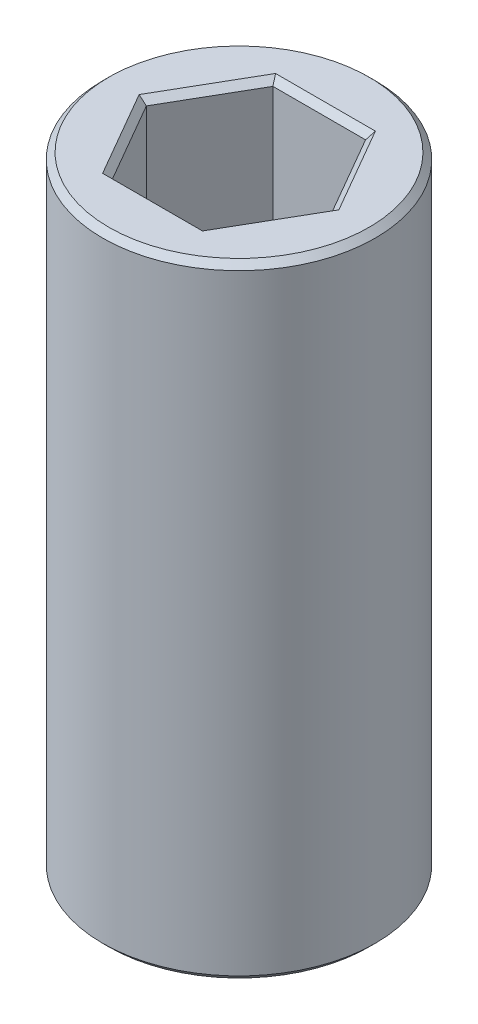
ISO-10303-21;
HEADER;
FILE_DESCRIPTION(('STEP AP214'),'2;1');
FILE_NAME('part.step','',(''),(''),'','','');
FILE_SCHEMA(('AUTOMOTIVE_DESIGN { 1 0 10303 214 1 1 1 1 }'));
ENDSEC;
DATA;
#1=APPLICATION_CONTEXT('core data for automotive mechanical design processes');
#2=APPLICATION_PROTOCOL_DEFINITION('international standard','automotive_design',2000,#1);
#3=PRODUCT_CONTEXT('',#1,'mechanical');
#4=PRODUCT('Part','Part','',(#3));
#5=PRODUCT_RELATED_PRODUCT_CATEGORY('part','',(#4));
#6=PRODUCT_DEFINITION_FORMATION('','',#4);
#7=PRODUCT_DEFINITION_CONTEXT('part definition',#1,'design');
#8=PRODUCT_DEFINITION('design','',#6,#7);
#9=PRODUCT_DEFINITION_SHAPE('','',#8);
#10=(LENGTH_UNIT() NAMED_UNIT(*) SI_UNIT(.MILLI.,.METRE.));
#11=(NAMED_UNIT(*) PLANE_ANGLE_UNIT() SI_UNIT($,.RADIAN.));
#12=(NAMED_UNIT(*) SI_UNIT($,.STERADIAN.) SOLID_ANGLE_UNIT());
#13=UNCERTAINTY_MEASURE_WITH_UNIT(LENGTH_MEASURE(1.E-05),#10,'distance_accuracy_value','');
#14=(GEOMETRIC_REPRESENTATION_CONTEXT(3) GLOBAL_UNCERTAINTY_ASSIGNED_CONTEXT((#13)) GLOBAL_UNIT_ASSIGNED_CONTEXT((#10,
#11,#12)) REPRESENTATION_CONTEXT('',''));
#15=CARTESIAN_POINT('',(0.,0.,0.));
#16=DIRECTION('',(0.,0.,1.));
#17=DIRECTION('',(1.,0.,0.));
#18=AXIS2_PLACEMENT_3D('',#15,#16,#17);
#19=CARTESIAN_POINT('',(0.,50.8,0.));
#20=DIRECTION('',(0.,1.,0.));
#21=DIRECTION('',(0.,0.,1.));
#22=AXIS2_PLACEMENT_3D('',#19,#20,#21);
#23=PLANE('',#22);
#24=CARTESIAN_POINT('',(0.,50.8,0.));
#25=DIRECTION('',(0.,1.,0.));
#26=DIRECTION('',(0.,0.,1.));
#27=AXIS2_PLACEMENT_3D('',#24,#25,#26);
#28=CIRCLE('',#27,10.6045);
#29=CARTESIAN_POINT('',(0.,50.8,10.6045));
#30=VERTEX_POINT('',#29);
#31=EDGE_CURVE('E13',#30,#30,#28,.T.);
#32=ORIENTED_EDGE('',*,*,#31,.T.);
#33=EDGE_LOOP('',(#32));
#34=FACE_BOUND('',#33,.T.);
#35=DIRECTION('',(-0.500000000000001,0.,-0.866025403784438));
#36=VECTOR('',#35,1.);
#37=CARTESIAN_POINT('',(-6.10418005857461,50.8,3.52425));
#38=LINE('',#37,#36);
#39=CARTESIAN_POINT('',(-4.06945337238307,50.8,7.0485));
#40=VERTEX_POINT('',#39);
#41=CARTESIAN_POINT('',(-8.13890674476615,50.8,0.));
#42=VERTEX_POINT('',#41);
#43=EDGE_CURVE('E70',#40,#42,#38,.T.);
#44=ORIENTED_EDGE('',*,*,#43,.T.);
#45=DIRECTION('',(0.5,0.,-0.866025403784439));
#46=VECTOR('',#45,1.);
#47=CARTESIAN_POINT('',(-6.10418005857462,50.8,-3.52425));
#48=LINE('',#47,#46);
#49=CARTESIAN_POINT('',(-4.06945337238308,50.8,-7.0485));
#50=VERTEX_POINT('',#49);
#51=EDGE_CURVE('E62',#42,#50,#48,.T.);
#52=ORIENTED_EDGE('',*,*,#51,.T.);
#53=DIRECTION('',(1.,0.,0.));
#54=VECTOR('',#53,1.);
#55=CARTESIAN_POINT('',(0.,50.8,-7.0485));
#56=LINE('',#55,#54);
#57=CARTESIAN_POINT('',(4.06945337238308,50.8,-7.0485));
#58=VERTEX_POINT('',#57);
#59=EDGE_CURVE('E238',#50,#58,#56,.T.);
#60=ORIENTED_EDGE('',*,*,#59,.T.);
#61=DIRECTION('',(0.5,0.,0.866025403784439));
#62=VECTOR('',#61,1.);
#63=CARTESIAN_POINT('',(6.10418005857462,50.8,-3.52425));
#64=LINE('',#63,#62);
#65=CARTESIAN_POINT('',(8.13890674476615,50.8,0.));
#66=VERTEX_POINT('',#65);
#67=EDGE_CURVE('E241',#58,#66,#64,.T.);
#68=ORIENTED_EDGE('',*,*,#67,.T.);
#69=DIRECTION('',(-0.499999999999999,0.,0.866025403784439));
#70=VECTOR('',#69,1.);
#71=CARTESIAN_POINT('',(6.10418005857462,50.8,3.52425));
#72=LINE('',#71,#70);
#73=CARTESIAN_POINT('',(4.06945337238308,50.8,7.0485));
#74=VERTEX_POINT('',#73);
#75=EDGE_CURVE('E244',#66,#74,#72,.T.);
#76=ORIENTED_EDGE('',*,*,#75,.T.);
#77=DIRECTION('',(-1.,0.,0.));
#78=VECTOR('',#77,1.);
#79=CARTESIAN_POINT('',(0.,50.8,7.0485));
#80=LINE('',#79,#78);
#81=EDGE_CURVE('E75',#74,#40,#80,.T.);
#82=ORIENTED_EDGE('',*,*,#81,.T.);
#83=EDGE_LOOP('',(#44,#52,#60,#68,#76,#82));
#84=FACE_BOUND('',#83,.T.);
#85=ADVANCED_FACE('F51',(#34,#84),#23,.T.);
#86=CARTESIAN_POINT('',(0.,0.,0.));
#87=DIRECTION('',(0.,1.,0.));
#88=DIRECTION('',(0.,0.,1.));
#89=AXIS2_PLACEMENT_3D('',#86,#87,#88);
#90=PLANE('',#89);
#91=DIRECTION('',(0.499999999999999,0.,-0.866025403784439));
#92=VECTOR('',#91,1.);
#93=CARTESIAN_POINT('',(7.99225977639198,0.,0.253999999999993));
#94=LINE('',#93,#92);
#95=CARTESIAN_POINT('',(4.06945337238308,0.,7.0485));
#96=VERTEX_POINT('',#95);
#97=CARTESIAN_POINT('',(8.13890674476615,0.,0.));
#98=VERTEX_POINT('',#97);
#99=EDGE_CURVE('E149',#96,#98,#94,.T.);
#100=ORIENTED_EDGE('',*,*,#99,.T.);
#101=DIRECTION('',(-0.5,0.,-0.866025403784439));
#102=VECTOR('',#101,1.);
#103=CARTESIAN_POINT('',(4.21610034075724,0.,-6.7945));
#104=LINE('',#103,#102);
#105=CARTESIAN_POINT('',(4.06945337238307,0.,-7.0485));
#106=VERTEX_POINT('',#105);
#107=EDGE_CURVE('E190',#98,#106,#104,.T.);
#108=ORIENTED_EDGE('',*,*,#107,.T.);
#109=DIRECTION('',(-1.,0.,0.));
#110=VECTOR('',#109,1.);
#111=CARTESIAN_POINT('',(-3.77615943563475,0.,-7.0485));
#112=LINE('',#111,#110);
#113=CARTESIAN_POINT('',(-4.06945337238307,0.,-7.0485));
#114=VERTEX_POINT('',#113);
#115=EDGE_CURVE('E187',#106,#114,#112,.T.);
#116=ORIENTED_EDGE('',*,*,#115,.T.);
#117=DIRECTION('',(-0.5,0.,0.866025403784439));
#118=VECTOR('',#117,1.);
#119=CARTESIAN_POINT('',(-7.99225977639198,0.,-0.253999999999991));
#120=LINE('',#119,#118);
#121=CARTESIAN_POINT('',(-8.13890674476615,0.,0.));
#122=VERTEX_POINT('',#121);
#123=EDGE_CURVE('E184',#114,#122,#120,.T.);
#124=ORIENTED_EDGE('',*,*,#123,.T.);
#125=DIRECTION('',(0.500000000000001,0.,0.866025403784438));
#126=VECTOR('',#125,1.);
#127=CARTESIAN_POINT('',(-4.21610034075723,0.,6.7945));
#128=LINE('',#127,#126);
#129=CARTESIAN_POINT('',(-4.06945337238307,0.,7.0485));
#130=VERTEX_POINT('',#129);
#131=EDGE_CURVE('E152',#122,#130,#128,.T.);
#132=ORIENTED_EDGE('',*,*,#131,.T.);
#133=DIRECTION('',(1.,0.,0.));
#134=VECTOR('',#133,1.);
#135=CARTESIAN_POINT('',(3.77615943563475,0.,7.0485));
#136=LINE('',#135,#134);
#137=EDGE_CURVE('E143',#130,#96,#136,.T.);
#138=ORIENTED_EDGE('',*,*,#137,.T.);
#139=EDGE_LOOP('',(#100,#108,#116,#124,#132,#138));
#140=FACE_BOUND('',#139,.T.);
#141=CARTESIAN_POINT('',(0.,0.,0.));
#142=DIRECTION('',(0.,1.,0.));
#143=DIRECTION('',(0.,0.,1.));
#144=AXIS2_PLACEMENT_3D('',#141,#142,#143);
#145=CIRCLE('',#144,10.6045);
#146=CARTESIAN_POINT('',(0.,0.,10.6045));
#147=VERTEX_POINT('',#146);
#148=EDGE_CURVE('E173',#147,#147,#145,.F.);
#149=ORIENTED_EDGE('',*,*,#148,.T.);
#150=EDGE_LOOP('',(#149));
#151=FACE_BOUND('',#150,.T.);
#152=ADVANCED_FACE('F145',(#140,#151),#90,.F.);
#153=CARTESIAN_POINT('',(0.,50.8,0.));
#154=DIRECTION('',(0.,-1.,0.));
#155=DIRECTION('',(0.,0.,-1.));
#156=AXIS2_PLACEMENT_3D('',#153,#154,#155);
#157=CYLINDRICAL_SURFACE('',#156,11.1125);
#158=CARTESIAN_POINT('',(0.,0.507999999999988,0.));
#159=DIRECTION('',(0.,1.,0.));
#160=DIRECTION('',(0.,0.,1.));
#161=AXIS2_PLACEMENT_3D('',#158,#159,#160);
#162=CIRCLE('',#161,11.1125);
#163=CARTESIAN_POINT('',(0.,0.507999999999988,11.1125));
#164=VERTEX_POINT('',#163);
#165=EDGE_CURVE('E234',#164,#164,#162,.T.);
#166=ORIENTED_EDGE('',*,*,#165,.T.);
#167=EDGE_LOOP('',(#166));
#168=FACE_BOUND('',#167,.T.);
#169=CARTESIAN_POINT('',(0.,50.292,0.));
#170=DIRECTION('',(0.,1.,0.));
#171=DIRECTION('',(0.,0.,1.));
#172=AXIS2_PLACEMENT_3D('',#169,#170,#171);
#173=CIRCLE('',#172,11.1125);
#174=CARTESIAN_POINT('',(0.,50.292,11.1125));
#175=VERTEX_POINT('',#174);
#176=EDGE_CURVE('E230',#175,#175,#173,.F.);
#177=ORIENTED_EDGE('',*,*,#176,.T.);
#178=EDGE_LOOP('',(#177));
#179=FACE_BOUND('',#178,.T.);
#180=ADVANCED_FACE('F387',(#168,#179),#157,.T.);
#181=CARTESIAN_POINT('',(3.77615943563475,50.8,6.5405));
#182=DIRECTION('',(-0.866025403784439,0.,-0.5));
#183=DIRECTION('',(-0.499999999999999,0.,0.866025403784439));
#184=AXIS2_PLACEMENT_3D('',#181,#182,#183);
#185=PLANE('',#184);
#186=DIRECTION('',(0.,-1.,0.));
#187=VECTOR('',#186,1.);
#188=CARTESIAN_POINT('',(7.55231887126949,50.8,0.));
#189=LINE('',#188,#187);
#190=CARTESIAN_POINT('',(7.55231887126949,50.292,0.));
#191=VERTEX_POINT('',#190);
#192=CARTESIAN_POINT('',(7.55231887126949,0.507999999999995,0.));
#193=VERTEX_POINT('',#192);
#194=EDGE_CURVE('E178',#191,#193,#189,.T.);
#195=ORIENTED_EDGE('',*,*,#194,.T.);
#196=DIRECTION('',(-0.499999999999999,0.,0.866025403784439));
#197=VECTOR('',#196,1.);
#198=CARTESIAN_POINT('',(3.77615943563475,0.507999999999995,6.5405));
#199=LINE('',#198,#197);
#200=CARTESIAN_POINT('',(3.77615943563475,0.507999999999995,6.5405));
#201=VERTEX_POINT('',#200);
#202=EDGE_CURVE('E227',#193,#201,#199,.T.);
#203=ORIENTED_EDGE('',*,*,#202,.T.);
#204=DIRECTION('',(0.,-1.,0.));
#205=VECTOR('',#204,1.);
#206=CARTESIAN_POINT('',(3.77615943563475,50.8,6.5405));
#207=LINE('',#206,#205);
#208=CARTESIAN_POINT('',(3.77615943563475,50.292,6.5405));
#209=VERTEX_POINT('',#208);
#210=EDGE_CURVE('E267',#209,#201,#207,.T.);
#211=ORIENTED_EDGE('',*,*,#210,.F.);
#212=DIRECTION('',(0.499999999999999,0.,-0.866025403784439));
#213=VECTOR('',#212,1.);
#214=CARTESIAN_POINT('',(3.77615943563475,50.292,6.5405));
#215=LINE('',#214,#213);
#216=EDGE_CURVE('E224',#209,#191,#215,.T.);
#217=ORIENTED_EDGE('',*,*,#216,.T.);
#218=EDGE_LOOP('',(#195,#203,#211,#217));
#219=FACE_BOUND('',#218,.T.);
#220=ADVANCED_FACE('F335',(#219),#185,.T.);
#221=CARTESIAN_POINT('',(7.55231887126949,50.8,0.));
#222=DIRECTION('',(-0.866025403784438,0.,0.5));
#223=DIRECTION('',(0.5,0.,0.866025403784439));
#224=AXIS2_PLACEMENT_3D('',#221,#222,#223);
#225=PLANE('',#224);
#226=DIRECTION('',(0.,-1.,0.));
#227=VECTOR('',#226,1.);
#228=CARTESIAN_POINT('',(3.77615943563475,50.8,-6.5405));
#229=LINE('',#228,#227);
#230=CARTESIAN_POINT('',(3.77615943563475,50.292,-6.5405));
#231=VERTEX_POINT('',#230);
#232=CARTESIAN_POINT('',(3.77615943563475,0.507999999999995,-6.5405));
#233=VERTEX_POINT('',#232);
#234=EDGE_CURVE('E314',#231,#233,#229,.T.);
#235=ORIENTED_EDGE('',*,*,#234,.T.);
#236=DIRECTION('',(0.5,0.,0.866025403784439));
#237=VECTOR('',#236,1.);
#238=CARTESIAN_POINT('',(7.55231887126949,0.507999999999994,0.));
#239=LINE('',#238,#237);
#240=EDGE_CURVE('E196',#233,#193,#239,.T.);
#241=ORIENTED_EDGE('',*,*,#240,.T.);
#242=ORIENTED_EDGE('',*,*,#194,.F.);
#243=DIRECTION('',(-0.5,0.,-0.866025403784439));
#244=VECTOR('',#243,1.);
#245=CARTESIAN_POINT('',(7.55231887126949,50.292,0.));
#246=LINE('',#245,#244);
#247=EDGE_CURVE('E193',#191,#231,#246,.T.);
#248=ORIENTED_EDGE('',*,*,#247,.T.);
#249=EDGE_LOOP('',(#235,#241,#242,#248));
#250=FACE_BOUND('',#249,.T.);
#251=ADVANCED_FACE('F339',(#250),#225,.T.);
#252=CARTESIAN_POINT('',(3.77615943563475,50.8,-6.5405));
#253=DIRECTION('',(0.,0.,1.));
#254=DIRECTION('',(1.,0.,0.));
#255=AXIS2_PLACEMENT_3D('',#252,#253,#254);
#256=PLANE('',#255);
#257=DIRECTION('',(0.,-1.,0.));
#258=VECTOR('',#257,1.);
#259=CARTESIAN_POINT('',(-3.77615943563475,50.8,-6.5405));
#260=LINE('',#259,#258);
#261=CARTESIAN_POINT('',(-3.77615943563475,50.292,-6.5405));
#262=VERTEX_POINT('',#261);
#263=CARTESIAN_POINT('',(-3.77615943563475,0.507999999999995,-6.5405));
#264=VERTEX_POINT('',#263);
#265=EDGE_CURVE('E311',#262,#264,#260,.T.);
#266=ORIENTED_EDGE('',*,*,#265,.T.);
#267=DIRECTION('',(1.,0.,0.));
#268=VECTOR('',#267,1.);
#269=CARTESIAN_POINT('',(3.77615943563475,0.507999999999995,-6.5405));
#270=LINE('',#269,#268);
#271=EDGE_CURVE('E203',#264,#233,#270,.T.);
#272=ORIENTED_EDGE('',*,*,#271,.T.);
#273=ORIENTED_EDGE('',*,*,#234,.F.);
#274=DIRECTION('',(-1.,0.,0.));
#275=VECTOR('',#274,1.);
#276=CARTESIAN_POINT('',(3.77615943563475,50.292,-6.5405));
#277=LINE('',#276,#275);
#278=EDGE_CURVE('E200',#231,#262,#277,.T.);
#279=ORIENTED_EDGE('',*,*,#278,.T.);
#280=EDGE_LOOP('',(#266,#272,#273,#279));
#281=FACE_BOUND('',#280,.T.);
#282=ADVANCED_FACE('F310',(#281),#256,.T.);
#283=CARTESIAN_POINT('',(-3.77615943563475,50.8,-6.5405));
#284=DIRECTION('',(0.866025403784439,0.,0.5));
#285=DIRECTION('',(0.5,0.,-0.866025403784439));
#286=AXIS2_PLACEMENT_3D('',#283,#284,#285);
#287=PLANE('',#286);
#288=DIRECTION('',(0.,-1.,0.));
#289=VECTOR('',#288,1.);
#290=CARTESIAN_POINT('',(-7.55231887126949,50.8,0.));
#291=LINE('',#290,#289);
#292=CARTESIAN_POINT('',(-7.55231887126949,50.292,0.));
#293=VERTEX_POINT('',#292);
#294=CARTESIAN_POINT('',(-7.55231887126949,0.507999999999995,0.));
#295=VERTEX_POINT('',#294);
#296=EDGE_CURVE('E321',#293,#295,#291,.T.);
#297=ORIENTED_EDGE('',*,*,#296,.T.);
#298=DIRECTION('',(0.5,0.,-0.866025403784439));
#299=VECTOR('',#298,1.);
#300=CARTESIAN_POINT('',(-3.77615943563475,0.507999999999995,-6.5405));
#301=LINE('',#300,#299);
#302=EDGE_CURVE('E210',#295,#264,#301,.T.);
#303=ORIENTED_EDGE('',*,*,#302,.T.);
#304=ORIENTED_EDGE('',*,*,#265,.F.);
#305=DIRECTION('',(-0.5,0.,0.866025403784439));
#306=VECTOR('',#305,1.);
#307=CARTESIAN_POINT('',(-3.77615943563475,50.292,-6.5405));
#308=LINE('',#307,#306);
#309=EDGE_CURVE('E206',#262,#293,#308,.T.);
#310=ORIENTED_EDGE('',*,*,#309,.T.);
#311=EDGE_LOOP('',(#297,#303,#304,#310));
#312=FACE_BOUND('',#311,.T.);
#313=ADVANCED_FACE('F317',(#312),#287,.T.);
#314=CARTESIAN_POINT('',(-7.55231887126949,50.8,0.));
#315=DIRECTION('',(0.866025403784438,0.,-0.5));
#316=DIRECTION('',(-0.500000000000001,0.,-0.866025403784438));
#317=AXIS2_PLACEMENT_3D('',#314,#315,#316);
#318=PLANE('',#317);
#319=DIRECTION('',(0.,-1.,0.));
#320=VECTOR('',#319,1.);
#321=CARTESIAN_POINT('',(-3.77615943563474,50.8,6.5405));
#322=LINE('',#321,#320);
#323=CARTESIAN_POINT('',(-3.77615943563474,50.292,6.5405));
#324=VERTEX_POINT('',#323);
#325=CARTESIAN_POINT('',(-3.77615943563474,0.507999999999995,6.5405));
#326=VERTEX_POINT('',#325);
#327=EDGE_CURVE('E327',#324,#326,#322,.T.);
#328=ORIENTED_EDGE('',*,*,#327,.T.);
#329=DIRECTION('',(-0.500000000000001,0.,-0.866025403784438));
#330=VECTOR('',#329,1.);
#331=CARTESIAN_POINT('',(-7.55231887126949,0.507999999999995,0.));
#332=LINE('',#331,#330);
#333=EDGE_CURVE('E216',#326,#295,#332,.T.);
#334=ORIENTED_EDGE('',*,*,#333,.T.);
#335=ORIENTED_EDGE('',*,*,#296,.F.);
#336=DIRECTION('',(0.500000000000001,0.,0.866025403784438));
#337=VECTOR('',#336,1.);
#338=CARTESIAN_POINT('',(-7.55231887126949,50.292,0.));
#339=LINE('',#338,#337);
#340=EDGE_CURVE('E213',#293,#324,#339,.T.);
#341=ORIENTED_EDGE('',*,*,#340,.T.);
#342=EDGE_LOOP('',(#328,#334,#335,#341));
#343=FACE_BOUND('',#342,.T.);
#344=ADVANCED_FACE('F357',(#343),#318,.T.);
#345=CARTESIAN_POINT('',(-3.77615943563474,50.8,6.5405));
#346=DIRECTION('',(0.,0.,-1.));
#347=DIRECTION('',(-1.,0.,0.));
#348=AXIS2_PLACEMENT_3D('',#345,#346,#347);
#349=PLANE('',#348);
#350=ORIENTED_EDGE('',*,*,#210,.T.);
#351=DIRECTION('',(-1.,0.,0.));
#352=VECTOR('',#351,1.);
#353=CARTESIAN_POINT('',(-3.77615943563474,0.507999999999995,6.5405));
#354=LINE('',#353,#352);
#355=EDGE_CURVE('E162',#201,#326,#354,.T.);
#356=ORIENTED_EDGE('',*,*,#355,.T.);
#357=ORIENTED_EDGE('',*,*,#327,.F.);
#358=DIRECTION('',(1.,0.,0.));
#359=VECTOR('',#358,1.);
#360=CARTESIAN_POINT('',(-3.77615943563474,50.292,6.5405));
#361=LINE('',#360,#359);
#362=EDGE_CURVE('E219',#324,#209,#361,.T.);
#363=ORIENTED_EDGE('',*,*,#362,.T.);
#364=EDGE_LOOP('',(#350,#356,#357,#363));
#365=FACE_BOUND('',#364,.T.);
#366=ADVANCED_FACE('F366',(#365),#349,.T.);
#367=CARTESIAN_POINT('',(-6.10418005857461,0.,3.52425));
#368=DIRECTION('',(0.612372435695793,-0.707106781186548,-0.353553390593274));
#369=DIRECTION('',(-0.500000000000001,0.,-0.866025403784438));
#370=AXIS2_PLACEMENT_3D('',#367,#368,#369);
#371=PLANE('',#370);
#372=DIRECTION('',(0.755928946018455,0.654653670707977,0.));
#373=VECTOR('',#372,1.);
#374=CARTESIAN_POINT('',(-6.97620578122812,1.00692857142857,0.));
#375=LINE('',#374,#373);
#376=EDGE_CURVE('E166',#295,#122,#375,.F.);
#377=ORIENTED_EDGE('',*,*,#376,.F.);
#378=ORIENTED_EDGE('',*,*,#333,.F.);
#379=DIRECTION('',(0.377964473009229,0.654653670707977,-0.654653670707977));
#380=VECTOR('',#379,1.);
#381=CARTESIAN_POINT('',(-3.48810289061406,1.00692857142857,6.04157142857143));
#382=LINE('',#381,#380);
#383=EDGE_CURVE('E264',#130,#326,#382,.T.);
#384=ORIENTED_EDGE('',*,*,#383,.F.);
#385=ORIENTED_EDGE('',*,*,#131,.F.);
#386=EDGE_LOOP('',(#377,#378,#384,#385));
#387=FACE_BOUND('',#386,.T.);
#388=ADVANCED_FACE('F354',(#387),#371,.T.);
#389=CARTESIAN_POINT('',(0.,0.,7.0485));
#390=DIRECTION('',(0.,-0.707106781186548,-0.707106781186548));
#391=DIRECTION('',(-1.,0.,0.));
#392=AXIS2_PLACEMENT_3D('',#389,#390,#391);
#393=PLANE('',#392);
#394=ORIENTED_EDGE('',*,*,#383,.T.);
#395=ORIENTED_EDGE('',*,*,#355,.F.);
#396=DIRECTION('',(-0.377964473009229,0.654653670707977,-0.654653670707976));
#397=VECTOR('',#396,1.);
#398=CARTESIAN_POINT('',(3.48810289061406,1.00692857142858,6.04157142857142));
#399=LINE('',#398,#397);
#400=EDGE_CURVE('E160',#96,#201,#399,.T.);
#401=ORIENTED_EDGE('',*,*,#400,.F.);
#402=ORIENTED_EDGE('',*,*,#137,.F.);
#403=EDGE_LOOP('',(#394,#395,#401,#402));
#404=FACE_BOUND('',#403,.T.);
#405=ADVANCED_FACE('F161',(#404),#393,.T.);
#406=CARTESIAN_POINT('',(-6.10418005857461,0.,-3.52424999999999));
#407=DIRECTION('',(0.612372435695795,-0.707106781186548,0.353553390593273));
#408=DIRECTION('',(0.5,0.,-0.866025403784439));
#409=AXIS2_PLACEMENT_3D('',#406,#407,#408);
#410=PLANE('',#409);
#411=ORIENTED_EDGE('',*,*,#376,.T.);
#412=ORIENTED_EDGE('',*,*,#123,.F.);
#413=DIRECTION('',(0.377964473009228,0.654653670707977,0.654653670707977));
#414=VECTOR('',#413,1.);
#415=CARTESIAN_POINT('',(-3.48810289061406,1.00692857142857,-6.04157142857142));
#416=LINE('',#415,#414);
#417=EDGE_CURVE('E167',#264,#114,#416,.F.);
#418=ORIENTED_EDGE('',*,*,#417,.F.);
#419=ORIENTED_EDGE('',*,*,#302,.F.);
#420=EDGE_LOOP('',(#411,#412,#418,#419));
#421=FACE_BOUND('',#420,.T.);
#422=ADVANCED_FACE('F350',(#421),#410,.T.);
#423=CARTESIAN_POINT('',(6.10418005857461,0.,3.52424999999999));
#424=DIRECTION('',(-0.612372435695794,-0.707106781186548,-0.353553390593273));
#425=DIRECTION('',(-0.499999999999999,0.,0.866025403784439));
#426=AXIS2_PLACEMENT_3D('',#423,#424,#425);
#427=PLANE('',#426);
#428=ORIENTED_EDGE('',*,*,#400,.T.);
#429=ORIENTED_EDGE('',*,*,#202,.F.);
#430=DIRECTION('',(0.755928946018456,-0.654653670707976,0.));
#431=VECTOR('',#430,1.);
#432=CARTESIAN_POINT('',(6.97620578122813,1.00692857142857,0.));
#433=LINE('',#432,#431);
#434=EDGE_CURVE('E170',#98,#193,#433,.F.);
#435=ORIENTED_EDGE('',*,*,#434,.F.);
#436=ORIENTED_EDGE('',*,*,#99,.F.);
#437=EDGE_LOOP('',(#428,#429,#435,#436));
#438=FACE_BOUND('',#437,.T.);
#439=ADVANCED_FACE('F169',(#438),#427,.T.);
#440=CARTESIAN_POINT('',(0.,0.,-7.0485));
#441=DIRECTION('',(0.,-0.707106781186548,0.707106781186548));
#442=DIRECTION('',(1.,0.,0.));
#443=AXIS2_PLACEMENT_3D('',#440,#441,#442);
#444=PLANE('',#443);
#445=ORIENTED_EDGE('',*,*,#417,.T.);
#446=ORIENTED_EDGE('',*,*,#115,.F.);
#447=DIRECTION('',(-0.37796447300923,0.654653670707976,0.654653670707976));
#448=VECTOR('',#447,1.);
#449=CARTESIAN_POINT('',(3.48810289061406,1.00692857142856,-6.04157142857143));
#450=LINE('',#449,#448);
#451=EDGE_CURVE('E253',#233,#106,#450,.F.);
#452=ORIENTED_EDGE('',*,*,#451,.F.);
#453=ORIENTED_EDGE('',*,*,#271,.F.);
#454=EDGE_LOOP('',(#445,#446,#452,#453));
#455=FACE_BOUND('',#454,.T.);
#456=ADVANCED_FACE('F347',(#455),#444,.T.);
#457=CARTESIAN_POINT('',(6.10418005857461,0.,-3.52425));
#458=DIRECTION('',(-0.612372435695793,-0.707106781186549,0.353553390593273));
#459=DIRECTION('',(0.5,0.,0.866025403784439));
#460=AXIS2_PLACEMENT_3D('',#457,#458,#459);
#461=PLANE('',#460);
#462=ORIENTED_EDGE('',*,*,#434,.T.);
#463=ORIENTED_EDGE('',*,*,#240,.F.);
#464=ORIENTED_EDGE('',*,*,#451,.T.);
#465=ORIENTED_EDGE('',*,*,#107,.F.);
#466=EDGE_LOOP('',(#462,#463,#464,#465));
#467=FACE_BOUND('',#466,.T.);
#468=ADVANCED_FACE('F343',(#467),#461,.T.);
#469=CARTESIAN_POINT('',(0.,0.507999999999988,0.));
#470=DIRECTION('',(0.,1.,0.));
#471=DIRECTION('',(0.,0.,1.));
#472=AXIS2_PLACEMENT_3D('',#469,#470,#471);
#473=CONICAL_SURFACE('',#472,11.1125,0.78539816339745);
#474=ORIENTED_EDGE('',*,*,#148,.F.);
#475=EDGE_LOOP('',(#474));
#476=FACE_BOUND('',#475,.T.);
#477=ORIENTED_EDGE('',*,*,#165,.F.);
#478=EDGE_LOOP('',(#477));
#479=FACE_BOUND('',#478,.T.);
#480=ADVANCED_FACE('F402',(#476,#479),#473,.T.);
#481=CARTESIAN_POINT('',(0.,50.8,0.));
#482=DIRECTION('',(0.,-1.,0.));
#483=DIRECTION('',(0.,0.,-1.));
#484=AXIS2_PLACEMENT_3D('',#481,#482,#483);
#485=CONICAL_SURFACE('',#484,10.6045,0.785398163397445);
#486=ORIENTED_EDGE('',*,*,#176,.F.);
#487=EDGE_LOOP('',(#486));
#488=FACE_BOUND('',#487,.T.);
#489=ORIENTED_EDGE('',*,*,#31,.F.);
#490=EDGE_LOOP('',(#489));
#491=FACE_BOUND('',#490,.T.);
#492=ADVANCED_FACE('F431',(#488,#491),#485,.T.);
#493=CARTESIAN_POINT('',(3.77615943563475,50.292,6.5405));
#494=DIRECTION('',(0.612372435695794,-0.707106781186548,0.353553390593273));
#495=DIRECTION('',(0.499999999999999,0.,-0.866025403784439));
#496=AXIS2_PLACEMENT_3D('',#493,#494,#495);
#497=PLANE('',#496);
#498=DIRECTION('',(0.377964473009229,0.654653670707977,0.654653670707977));
#499=VECTOR('',#498,1.);
#500=CARTESIAN_POINT('',(2.6972567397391,48.4232857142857,4.67178571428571));
#501=LINE('',#500,#499);
#502=EDGE_CURVE('E281',#74,#209,#501,.F.);
#503=ORIENTED_EDGE('',*,*,#502,.F.);
#504=ORIENTED_EDGE('',*,*,#75,.F.);
#505=DIRECTION('',(0.755928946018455,0.654653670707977,0.));
#506=VECTOR('',#505,1.);
#507=CARTESIAN_POINT('',(5.39451347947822,48.4232857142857,0.));
#508=LINE('',#507,#506);
#509=EDGE_CURVE('E56',#191,#66,#508,.T.);
#510=ORIENTED_EDGE('',*,*,#509,.F.);
#511=ORIENTED_EDGE('',*,*,#216,.F.);
#512=EDGE_LOOP('',(#503,#504,#510,#511));
#513=FACE_BOUND('',#512,.T.);
#514=ADVANCED_FACE('F54',(#513),#497,.F.);
#515=CARTESIAN_POINT('',(7.55231887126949,50.292,0.));
#516=DIRECTION('',(0.612372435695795,-0.707106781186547,-0.353553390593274));
#517=DIRECTION('',(-0.5,0.,-0.866025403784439));
#518=AXIS2_PLACEMENT_3D('',#515,#516,#517);
#519=PLANE('',#518);
#520=ORIENTED_EDGE('',*,*,#509,.T.);
#521=ORIENTED_EDGE('',*,*,#67,.F.);
#522=DIRECTION('',(0.377964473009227,0.654653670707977,-0.654653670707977));
#523=VECTOR('',#522,1.);
#524=CARTESIAN_POINT('',(2.69725673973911,48.4232857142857,-4.67178571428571));
#525=LINE('',#524,#523);
#526=EDGE_CURVE('E278',#231,#58,#525,.T.);
#527=ORIENTED_EDGE('',*,*,#526,.F.);
#528=ORIENTED_EDGE('',*,*,#247,.F.);
#529=EDGE_LOOP('',(#520,#521,#527,#528));
#530=FACE_BOUND('',#529,.T.);
#531=ADVANCED_FACE('F295',(#530),#519,.F.);
#532=CARTESIAN_POINT('',(-3.77615943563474,50.292,6.5405));
#533=DIRECTION('',(0.,-0.707106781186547,0.707106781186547));
#534=DIRECTION('',(1.,0.,0.));
#535=AXIS2_PLACEMENT_3D('',#532,#533,#534);
#536=PLANE('',#535);
#537=ORIENTED_EDGE('',*,*,#502,.T.);
#538=ORIENTED_EDGE('',*,*,#362,.F.);
#539=DIRECTION('',(-0.377964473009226,0.654653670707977,0.654653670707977));
#540=VECTOR('',#539,1.);
#541=CARTESIAN_POINT('',(-2.6972567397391,48.4232857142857,4.67178571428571));
#542=LINE('',#541,#540);
#543=EDGE_CURVE('E274',#40,#324,#542,.F.);
#544=ORIENTED_EDGE('',*,*,#543,.F.);
#545=ORIENTED_EDGE('',*,*,#81,.F.);
#546=EDGE_LOOP('',(#537,#538,#544,#545));
#547=FACE_BOUND('',#546,.T.);
#548=ADVANCED_FACE('F367',(#547),#536,.F.);
#549=CARTESIAN_POINT('',(3.77615943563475,50.292,-6.5405));
#550=DIRECTION('',(0.,-0.707106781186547,-0.707106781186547));
#551=DIRECTION('',(-1.,0.,0.));
#552=AXIS2_PLACEMENT_3D('',#549,#550,#551);
#553=PLANE('',#552);
#554=ORIENTED_EDGE('',*,*,#526,.T.);
#555=ORIENTED_EDGE('',*,*,#59,.F.);
#556=DIRECTION('',(0.377964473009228,-0.654653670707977,0.654653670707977));
#557=VECTOR('',#556,1.);
#558=CARTESIAN_POINT('',(-3.77615943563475,50.292,-6.5405));
#559=LINE('',#558,#557);
#560=EDGE_CURVE('E271',#262,#50,#559,.F.);
#561=ORIENTED_EDGE('',*,*,#560,.F.);
#562=ORIENTED_EDGE('',*,*,#278,.F.);
#563=EDGE_LOOP('',(#554,#555,#561,#562));
#564=FACE_BOUND('',#563,.T.);
#565=ADVANCED_FACE('F303',(#564),#553,.F.);
#566=CARTESIAN_POINT('',(-7.55231887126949,50.292,0.));
#567=DIRECTION('',(-0.612372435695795,-0.707106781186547,0.353553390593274));
#568=DIRECTION('',(0.500000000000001,0.,0.866025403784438));
#569=AXIS2_PLACEMENT_3D('',#566,#567,#568);
#570=PLANE('',#569);
#571=ORIENTED_EDGE('',*,*,#543,.T.);
#572=ORIENTED_EDGE('',*,*,#340,.F.);
#573=DIRECTION('',(-0.755928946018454,0.654653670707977,0.));
#574=VECTOR('',#573,1.);
#575=CARTESIAN_POINT('',(-5.39451347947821,48.4232857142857,0.));
#576=LINE('',#575,#574);
#577=EDGE_CURVE('E268',#42,#293,#576,.F.);
#578=ORIENTED_EDGE('',*,*,#577,.F.);
#579=ORIENTED_EDGE('',*,*,#43,.F.);
#580=EDGE_LOOP('',(#571,#572,#578,#579));
#581=FACE_BOUND('',#580,.T.);
#582=ADVANCED_FACE('F369',(#581),#570,.F.);
#583=CARTESIAN_POINT('',(-3.77615943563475,50.292,-6.5405));
#584=DIRECTION('',(-0.612372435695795,-0.707106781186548,-0.353553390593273));
#585=DIRECTION('',(-0.5,0.,0.866025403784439));
#586=AXIS2_PLACEMENT_3D('',#583,#584,#585);
#587=PLANE('',#586);
#588=ORIENTED_EDGE('',*,*,#560,.T.);
#589=ORIENTED_EDGE('',*,*,#51,.F.);
#590=ORIENTED_EDGE('',*,*,#577,.T.);
#591=ORIENTED_EDGE('',*,*,#309,.F.);
#592=EDGE_LOOP('',(#588,#589,#590,#591));
#593=FACE_BOUND('',#592,.T.);
#594=ADVANCED_FACE('F372',(#593),#587,.F.);
#595=CLOSED_SHELL('',(#85,#152,#180,#220,#251,#282,#313,#344,#366,#388,#405,#422,#439,#456,#468,
#480,#492,#514,#531,#548,#565,#582,#594));
#596=MANIFOLD_SOLID_BREP('B2',#595);
#597=ADVANCED_BREP_SHAPE_REPRESENTATION('',(#18,#596),#14);
#598=SHAPE_DEFINITION_REPRESENTATION(#9,#597);
ENDSEC;
END-ISO-10303-21;
